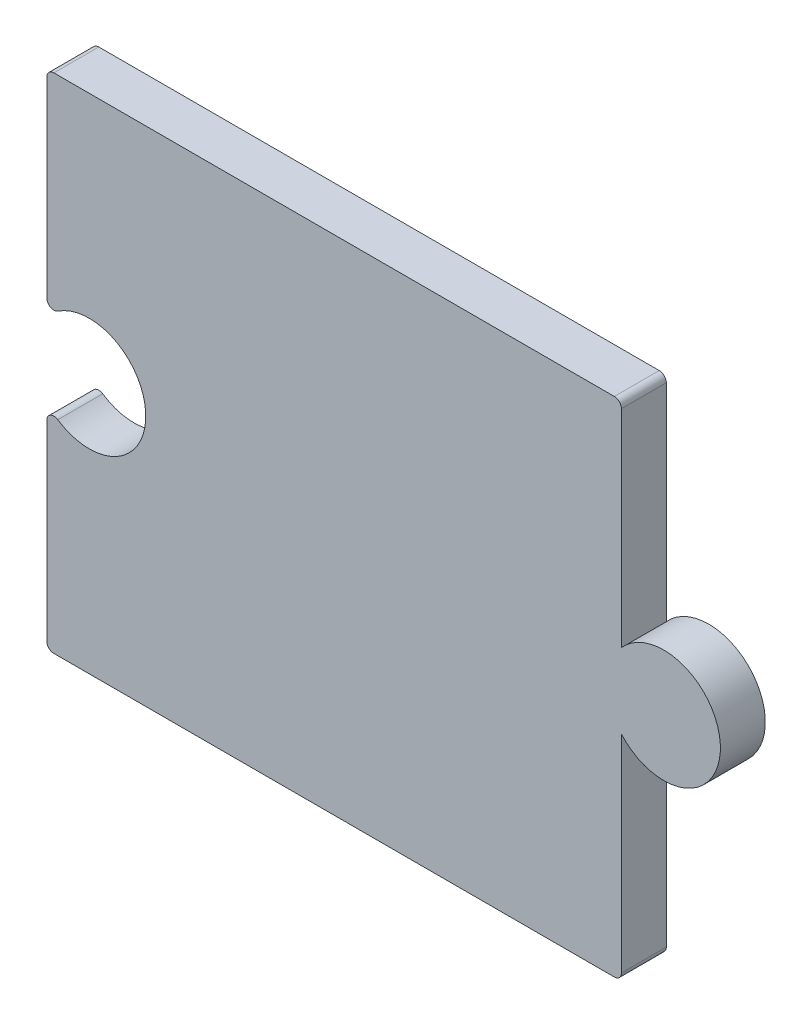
ISO-10303-21;
HEADER;
FILE_DESCRIPTION(('STEP AP214'),'2;1');
FILE_NAME('part.step','',(''),(''),'','','');
FILE_SCHEMA(('AUTOMOTIVE_DESIGN { 1 0 10303 214 1 1 1 1 }'));
ENDSEC;
DATA;
#1=APPLICATION_CONTEXT('core data for automotive mechanical design processes');
#2=APPLICATION_PROTOCOL_DEFINITION('international standard','automotive_design',2000,#1);
#3=PRODUCT_CONTEXT('',#1,'mechanical');
#4=PRODUCT('Part','Part','',(#3));
#5=PRODUCT_RELATED_PRODUCT_CATEGORY('part','',(#4));
#6=PRODUCT_DEFINITION_FORMATION('','',#4);
#7=PRODUCT_DEFINITION_CONTEXT('part definition',#1,'design');
#8=PRODUCT_DEFINITION('design','',#6,#7);
#9=PRODUCT_DEFINITION_SHAPE('','',#8);
#10=(LENGTH_UNIT() NAMED_UNIT(*) SI_UNIT(.MILLI.,.METRE.));
#11=(NAMED_UNIT(*) PLANE_ANGLE_UNIT() SI_UNIT($,.RADIAN.));
#12=(NAMED_UNIT(*) SI_UNIT($,.STERADIAN.) SOLID_ANGLE_UNIT());
#13=UNCERTAINTY_MEASURE_WITH_UNIT(LENGTH_MEASURE(1.E-05),#10,'distance_accuracy_value','');
#14=(GEOMETRIC_REPRESENTATION_CONTEXT(3) GLOBAL_UNCERTAINTY_ASSIGNED_CONTEXT((#13)) GLOBAL_UNIT_ASSIGNED_CONTEXT((#10,
#11,#12)) REPRESENTATION_CONTEXT('',''));
#15=CARTESIAN_POINT('',(0.,0.,0.));
#16=DIRECTION('',(0.,0.,1.));
#17=DIRECTION('',(1.,0.,0.));
#18=AXIS2_PLACEMENT_3D('',#15,#16,#17);
#19=CARTESIAN_POINT('',(0.,15.1342486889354,3.175));
#20=DIRECTION('',(1.,0.,0.));
#21=DIRECTION('',(0.,0.,-1.));
#22=AXIS2_PLACEMENT_3D('',#19,#20,#21);
#23=PLANE('',#22);
#24=DIRECTION('',(0.,-1.,0.));
#25=VECTOR('',#24,1.);
#26=CARTESIAN_POINT('',(0.,15.1342486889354,3.175));
#27=LINE('',#26,#25);
#28=CARTESIAN_POINT('',(0.,14.0383426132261,3.175));
#29=VERTEX_POINT('',#28);
#30=CARTESIAN_POINT('',(0.,0.5,3.175));
#31=VERTEX_POINT('',#30);
#32=EDGE_CURVE('E193',#29,#31,#27,.T.);
#33=ORIENTED_EDGE('',*,*,#32,.F.);
#34=DIRECTION('',(0.,0.,-1.));
#35=VECTOR('',#34,1.);
#36=CARTESIAN_POINT('',(0.,14.0383426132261,3.175));
#37=LINE('',#36,#35);
#38=CARTESIAN_POINT('',(0.,14.0383426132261,0.));
#39=VERTEX_POINT('',#38);
#40=EDGE_CURVE('E196',#29,#39,#37,.T.);
#41=ORIENTED_EDGE('',*,*,#40,.T.);
#42=DIRECTION('',(0.,-1.,0.));
#43=VECTOR('',#42,1.);
#44=CARTESIAN_POINT('',(0.,15.1342486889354,0.));
#45=LINE('',#44,#43);
#46=CARTESIAN_POINT('',(0.,0.5,0.));
#47=VERTEX_POINT('',#46);
#48=EDGE_CURVE('E173',#39,#47,#45,.T.);
#49=ORIENTED_EDGE('',*,*,#48,.T.);
#50=DIRECTION('',(0.,0.,-1.));
#51=VECTOR('',#50,1.);
#52=CARTESIAN_POINT('',(0.,0.5,3.175));
#53=LINE('',#52,#51);
#54=EDGE_CURVE('E156',#47,#31,#53,.F.);
#55=ORIENTED_EDGE('',*,*,#54,.T.);
#56=EDGE_LOOP('',(#33,#41,#49,#55));
#57=FACE_BOUND('',#56,.T.);
#58=ADVANCED_FACE('F33',(#57),#23,.F.);
#59=CARTESIAN_POINT('',(0.,0.,3.175));
#60=DIRECTION('',(0.,1.,0.));
#61=DIRECTION('',(-1.,0.,0.));
#62=AXIS2_PLACEMENT_3D('',#59,#60,#61);
#63=PLANE('',#62);
#64=DIRECTION('',(1.,0.,0.));
#65=VECTOR('',#64,1.);
#66=CARTESIAN_POINT('',(0.,0.,0.));
#67=LINE('',#66,#65);
#68=CARTESIAN_POINT('',(0.5,0.,0.));
#69=VERTEX_POINT('',#68);
#70=CARTESIAN_POINT('',(40.14,0.,0.));
#71=VERTEX_POINT('',#70);
#72=EDGE_CURVE('E176',#69,#71,#67,.T.);
#73=ORIENTED_EDGE('',*,*,#72,.T.);
#74=DIRECTION('',(0.,0.,-1.));
#75=VECTOR('',#74,1.);
#76=CARTESIAN_POINT('',(40.14,0.,3.175));
#77=LINE('',#76,#75);
#78=CARTESIAN_POINT('',(40.14,0.,3.175));
#79=VERTEX_POINT('',#78);
#80=EDGE_CURVE('E235',#71,#79,#77,.F.);
#81=ORIENTED_EDGE('',*,*,#80,.T.);
#82=DIRECTION('',(1.,0.,0.));
#83=VECTOR('',#82,1.);
#84=CARTESIAN_POINT('',(0.,0.,3.175));
#85=LINE('',#84,#83);
#86=CARTESIAN_POINT('',(0.5,0.,3.175));
#87=VERTEX_POINT('',#86);
#88=EDGE_CURVE('E147',#87,#79,#85,.T.);
#89=ORIENTED_EDGE('',*,*,#88,.F.);
#90=DIRECTION('',(0.,0.,-1.));
#91=VECTOR('',#90,1.);
#92=CARTESIAN_POINT('',(0.5,0.,3.175));
#93=LINE('',#92,#91);
#94=EDGE_CURVE('E232',#87,#69,#93,.T.);
#95=ORIENTED_EDGE('',*,*,#94,.T.);
#96=EDGE_LOOP('',(#73,#81,#89,#95));
#97=FACE_BOUND('',#96,.T.);
#98=ADVANCED_FACE('F294',(#97),#63,.F.);
#99=CARTESIAN_POINT('',(40.64,15.1342486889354,3.175));
#100=DIRECTION('',(-1.,0.,0.));
#101=DIRECTION('',(0.,-1.,0.));
#102=AXIS2_PLACEMENT_3D('',#99,#100,#101);
#103=PLANE('',#102);
#104=DIRECTION('',(0.,1.,0.));
#105=VECTOR('',#104,1.);
#106=CARTESIAN_POINT('',(40.64,15.1342486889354,3.175));
#107=LINE('',#106,#105);
#108=CARTESIAN_POINT('',(40.64,0.499999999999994,3.175));
#109=VERTEX_POINT('',#108);
#110=CARTESIAN_POINT('',(40.64,15.1342486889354,3.175));
#111=VERTEX_POINT('',#110);
#112=EDGE_CURVE('E133',#109,#111,#107,.T.);
#113=ORIENTED_EDGE('',*,*,#112,.F.);
#114=DIRECTION('',(0.,0.,-1.));
#115=VECTOR('',#114,1.);
#116=CARTESIAN_POINT('',(40.64,0.499999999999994,3.175));
#117=LINE('',#116,#115);
#118=CARTESIAN_POINT('',(40.64,0.499999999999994,0.));
#119=VERTEX_POINT('',#118);
#120=EDGE_CURVE('E230',#109,#119,#117,.T.);
#121=ORIENTED_EDGE('',*,*,#120,.T.);
#122=DIRECTION('',(0.,1.,0.));
#123=VECTOR('',#122,1.);
#124=CARTESIAN_POINT('',(40.64,15.1342486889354,0.));
#125=LINE('',#124,#123);
#126=CARTESIAN_POINT('',(40.64,15.1342486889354,0.));
#127=VERTEX_POINT('',#126);
#128=EDGE_CURVE('E153',#119,#127,#125,.T.);
#129=ORIENTED_EDGE('',*,*,#128,.T.);
#130=DIRECTION('',(0.,0.,-1.));
#131=VECTOR('',#130,1.);
#132=CARTESIAN_POINT('',(40.64,15.1342486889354,3.175));
#133=LINE('',#132,#131);
#134=EDGE_CURVE('E150',#111,#127,#133,.T.);
#135=ORIENTED_EDGE('',*,*,#134,.F.);
#136=EDGE_LOOP('',(#113,#121,#129,#135));
#137=FACE_BOUND('',#136,.T.);
#138=ADVANCED_FACE('F151',(#137),#103,.F.);
#139=CARTESIAN_POINT('',(43.64,17.78,3.175));
#140=DIRECTION('',(0.,0.,-1.));
#141=DIRECTION('',(-1.,0.,0.));
#142=AXIS2_PLACEMENT_3D('',#139,#140,#141);
#143=CYLINDRICAL_SURFACE('',#142,4.);
#144=CARTESIAN_POINT('',(43.64,17.78,0.));
#145=DIRECTION('',(0.,0.,1.));
#146=DIRECTION('',(1.,0.,0.));
#147=AXIS2_PLACEMENT_3D('',#144,#145,#146);
#148=CIRCLE('',#147,4.);
#149=CARTESIAN_POINT('',(40.64,20.4257513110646,0.));
#150=VERTEX_POINT('',#149);
#151=EDGE_CURVE('E180',#127,#150,#148,.T.);
#152=ORIENTED_EDGE('',*,*,#151,.T.);
#153=DIRECTION('',(0.,0.,-1.));
#154=VECTOR('',#153,1.);
#155=CARTESIAN_POINT('',(40.64,20.4257513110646,3.175));
#156=LINE('',#155,#154);
#157=CARTESIAN_POINT('',(40.64,20.4257513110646,3.175));
#158=VERTEX_POINT('',#157);
#159=EDGE_CURVE('E157',#158,#150,#156,.T.);
#160=ORIENTED_EDGE('',*,*,#159,.F.);
#161=CARTESIAN_POINT('',(43.64,17.78,3.175));
#162=DIRECTION('',(0.,0.,1.));
#163=DIRECTION('',(1.,0.,0.));
#164=AXIS2_PLACEMENT_3D('',#161,#162,#163);
#165=CIRCLE('',#164,4.);
#166=EDGE_CURVE('E139',#111,#158,#165,.T.);
#167=ORIENTED_EDGE('',*,*,#166,.F.);
#168=ORIENTED_EDGE('',*,*,#134,.T.);
#169=EDGE_LOOP('',(#152,#160,#167,#168));
#170=FACE_BOUND('',#169,.T.);
#171=ADVANCED_FACE('F159',(#170),#143,.T.);
#172=CARTESIAN_POINT('',(40.64,35.56,3.175));
#173=DIRECTION('',(-1.,0.,0.));
#174=DIRECTION('',(0.,-1.,0.));
#175=AXIS2_PLACEMENT_3D('',#172,#173,#174);
#176=PLANE('',#175);
#177=DIRECTION('',(0.,1.,0.));
#178=VECTOR('',#177,1.);
#179=CARTESIAN_POINT('',(40.64,35.56,0.));
#180=LINE('',#179,#178);
#181=CARTESIAN_POINT('',(40.64,35.06,0.));
#182=VERTEX_POINT('',#181);
#183=EDGE_CURVE('E182',#150,#182,#180,.T.);
#184=ORIENTED_EDGE('',*,*,#183,.T.);
#185=DIRECTION('',(0.,0.,-1.));
#186=VECTOR('',#185,1.);
#187=CARTESIAN_POINT('',(40.64,35.06,3.175));
#188=LINE('',#187,#186);
#189=CARTESIAN_POINT('',(40.64,35.06,3.175));
#190=VERTEX_POINT('',#189);
#191=EDGE_CURVE('E11',#182,#190,#188,.F.);
#192=ORIENTED_EDGE('',*,*,#191,.T.);
#193=DIRECTION('',(0.,1.,0.));
#194=VECTOR('',#193,1.);
#195=CARTESIAN_POINT('',(40.64,35.56,3.175));
#196=LINE('',#195,#194);
#197=EDGE_CURVE('E162',#158,#190,#196,.T.);
#198=ORIENTED_EDGE('',*,*,#197,.F.);
#199=ORIENTED_EDGE('',*,*,#159,.T.);
#200=EDGE_LOOP('',(#184,#192,#198,#199));
#201=FACE_BOUND('',#200,.T.);
#202=ADVANCED_FACE('F282',(#201),#176,.F.);
#203=CARTESIAN_POINT('',(0.,35.56,3.175));
#204=DIRECTION('',(0.,-1.,0.));
#205=DIRECTION('',(1.,0.,0.));
#206=AXIS2_PLACEMENT_3D('',#203,#204,#205);
#207=PLANE('',#206);
#208=DIRECTION('',(-1.,0.,0.));
#209=VECTOR('',#208,1.);
#210=CARTESIAN_POINT('',(0.,35.56,3.175));
#211=LINE('',#210,#209);
#212=CARTESIAN_POINT('',(40.14,35.56,3.175));
#213=VERTEX_POINT('',#212);
#214=CARTESIAN_POINT('',(0.5,35.56,3.175));
#215=VERTEX_POINT('',#214);
#216=EDGE_CURVE('E164',#213,#215,#211,.T.);
#217=ORIENTED_EDGE('',*,*,#216,.F.);
#218=DIRECTION('',(0.,0.,-1.));
#219=VECTOR('',#218,1.);
#220=CARTESIAN_POINT('',(40.14,35.56,3.175));
#221=LINE('',#220,#219);
#222=CARTESIAN_POINT('',(40.14,35.56,0.));
#223=VERTEX_POINT('',#222);
#224=EDGE_CURVE('E41',#213,#223,#221,.T.);
#225=ORIENTED_EDGE('',*,*,#224,.T.);
#226=DIRECTION('',(-1.,0.,0.));
#227=VECTOR('',#226,1.);
#228=CARTESIAN_POINT('',(0.,35.56,0.));
#229=LINE('',#228,#227);
#230=CARTESIAN_POINT('',(0.5,35.56,0.));
#231=VERTEX_POINT('',#230);
#232=EDGE_CURVE('E185',#223,#231,#229,.T.);
#233=ORIENTED_EDGE('',*,*,#232,.T.);
#234=DIRECTION('',(0.,0.,-1.));
#235=VECTOR('',#234,1.);
#236=CARTESIAN_POINT('',(0.5,35.56,3.175));
#237=LINE('',#236,#235);
#238=EDGE_CURVE('E237',#231,#215,#237,.F.);
#239=ORIENTED_EDGE('',*,*,#238,.T.);
#240=EDGE_LOOP('',(#217,#225,#233,#239));
#241=FACE_BOUND('',#240,.T.);
#242=ADVANCED_FACE('F243',(#241),#207,.F.);
#243=CARTESIAN_POINT('',(0.,35.56,3.175));
#244=DIRECTION('',(1.,0.,0.));
#245=DIRECTION('',(0.,0.,-1.));
#246=AXIS2_PLACEMENT_3D('',#243,#244,#245);
#247=PLANE('',#246);
#248=DIRECTION('',(0.,-1.,0.));
#249=VECTOR('',#248,1.);
#250=CARTESIAN_POINT('',(0.,35.56,0.));
#251=LINE('',#250,#249);
#252=CARTESIAN_POINT('',(0.,35.06,0.));
#253=VERTEX_POINT('',#252);
#254=CARTESIAN_POINT('',(0.,21.5216573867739,0.));
#255=VERTEX_POINT('',#254);
#256=EDGE_CURVE('E188',#253,#255,#251,.T.);
#257=ORIENTED_EDGE('',*,*,#256,.T.);
#258=DIRECTION('',(0.,0.,-1.));
#259=VECTOR('',#258,1.);
#260=CARTESIAN_POINT('',(0.,21.5216573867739,3.175));
#261=LINE('',#260,#259);
#262=CARTESIAN_POINT('',(0.,21.5216573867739,3.175));
#263=VERTEX_POINT('',#262);
#264=EDGE_CURVE('E48',#255,#263,#261,.F.);
#265=ORIENTED_EDGE('',*,*,#264,.T.);
#266=DIRECTION('',(0.,-1.,0.));
#267=VECTOR('',#266,1.);
#268=CARTESIAN_POINT('',(0.,35.56,3.175));
#269=LINE('',#268,#267);
#270=CARTESIAN_POINT('',(0.,35.06,3.175));
#271=VERTEX_POINT('',#270);
#272=EDGE_CURVE('E169',#271,#263,#269,.T.);
#273=ORIENTED_EDGE('',*,*,#272,.F.);
#274=DIRECTION('',(0.,0.,-1.));
#275=VECTOR('',#274,1.);
#276=CARTESIAN_POINT('',(0.,35.06,3.175));
#277=LINE('',#276,#275);
#278=EDGE_CURVE('E226',#271,#253,#277,.T.);
#279=ORIENTED_EDGE('',*,*,#278,.T.);
#280=EDGE_LOOP('',(#257,#265,#273,#279));
#281=FACE_BOUND('',#280,.T.);
#282=ADVANCED_FACE('F254',(#281),#247,.F.);
#283=CARTESIAN_POINT('',(3.,17.78,3.175));
#284=DIRECTION('',(0.,0.,-1.));
#285=DIRECTION('',(-1.,0.,0.));
#286=AXIS2_PLACEMENT_3D('',#283,#284,#285);
#287=CYLINDRICAL_SURFACE('',#286,4.);
#288=CARTESIAN_POINT('',(3.,17.78,0.));
#289=DIRECTION('',(0.,0.,-1.));
#290=DIRECTION('',(1.,0.,0.));
#291=AXIS2_PLACEMENT_3D('',#288,#289,#290);
#292=CIRCLE('',#291,4.);
#293=CARTESIAN_POINT('',(0.777777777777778,21.1059176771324,0.));
#294=VERTEX_POINT('',#293);
#295=CARTESIAN_POINT('',(0.777777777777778,14.4540823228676,0.));
#296=VERTEX_POINT('',#295);
#297=EDGE_CURVE('E190',#294,#296,#292,.T.);
#298=ORIENTED_EDGE('',*,*,#297,.T.);
#299=DIRECTION('',(0.,0.,-1.));
#300=VECTOR('',#299,1.);
#301=CARTESIAN_POINT('',(0.777777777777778,14.4540823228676,3.175));
#302=LINE('',#301,#300);
#303=CARTESIAN_POINT('',(0.777777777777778,14.4540823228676,3.175));
#304=VERTEX_POINT('',#303);
#305=EDGE_CURVE('E214',#296,#304,#302,.F.);
#306=ORIENTED_EDGE('',*,*,#305,.T.);
#307=CARTESIAN_POINT('',(3.,17.78,3.175));
#308=DIRECTION('',(0.,0.,-1.));
#309=DIRECTION('',(1.,0.,0.));
#310=AXIS2_PLACEMENT_3D('',#307,#308,#309);
#311=CIRCLE('',#310,4.);
#312=CARTESIAN_POINT('',(0.777777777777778,21.1059176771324,3.175));
#313=VERTEX_POINT('',#312);
#314=EDGE_CURVE('E171',#313,#304,#311,.T.);
#315=ORIENTED_EDGE('',*,*,#314,.F.);
#316=DIRECTION('',(0.,0.,-1.));
#317=VECTOR('',#316,1.);
#318=CARTESIAN_POINT('',(0.777777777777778,21.1059176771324,3.175));
#319=LINE('',#318,#317);
#320=EDGE_CURVE('E211',#313,#294,#319,.T.);
#321=ORIENTED_EDGE('',*,*,#320,.T.);
#322=EDGE_LOOP('',(#298,#306,#315,#321));
#323=FACE_BOUND('',#322,.T.);
#324=ADVANCED_FACE('F262',(#323),#287,.F.);
#325=CARTESIAN_POINT('',(43.64,17.78,3.175));
#326=DIRECTION('',(0.,0.,1.));
#327=DIRECTION('',(1.,0.,0.));
#328=AXIS2_PLACEMENT_3D('',#325,#326,#327);
#329=PLANE('',#328);
#330=ORIENTED_EDGE('',*,*,#314,.T.);
#331=CARTESIAN_POINT('',(0.5,14.0383426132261,3.175));
#332=DIRECTION('',(0.,0.,1.));
#333=DIRECTION('',(1.,0.,0.));
#334=AXIS2_PLACEMENT_3D('',#331,#332,#333);
#335=CIRCLE('',#334,0.5);
#336=EDGE_CURVE('E224',#304,#29,#335,.T.);
#337=ORIENTED_EDGE('',*,*,#336,.T.);
#338=ORIENTED_EDGE('',*,*,#32,.T.);
#339=CARTESIAN_POINT('',(0.5,0.5,3.175));
#340=DIRECTION('',(0.,0.,1.));
#341=DIRECTION('',(1.,0.,0.));
#342=AXIS2_PLACEMENT_3D('',#339,#340,#341);
#343=CIRCLE('',#342,0.5);
#344=EDGE_CURVE('E219',#31,#87,#343,.T.);
#345=ORIENTED_EDGE('',*,*,#344,.T.);
#346=ORIENTED_EDGE('',*,*,#88,.T.);
#347=CARTESIAN_POINT('',(40.14,0.499999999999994,3.175));
#348=DIRECTION('',(0.,0.,1.));
#349=DIRECTION('',(1.,0.,0.));
#350=AXIS2_PLACEMENT_3D('',#347,#348,#349);
#351=CIRCLE('',#350,0.5);
#352=EDGE_CURVE('E143',#79,#109,#351,.T.);
#353=ORIENTED_EDGE('',*,*,#352,.T.);
#354=ORIENTED_EDGE('',*,*,#112,.T.);
#355=ORIENTED_EDGE('',*,*,#166,.T.);
#356=ORIENTED_EDGE('',*,*,#197,.T.);
#357=CARTESIAN_POINT('',(40.14,35.06,3.175));
#358=DIRECTION('',(0.,0.,1.));
#359=DIRECTION('',(1.,0.,0.));
#360=AXIS2_PLACEMENT_3D('',#357,#358,#359);
#361=CIRCLE('',#360,0.5);
#362=EDGE_CURVE('E217',#190,#213,#361,.T.);
#363=ORIENTED_EDGE('',*,*,#362,.T.);
#364=ORIENTED_EDGE('',*,*,#216,.T.);
#365=CARTESIAN_POINT('',(0.5,35.06,3.175));
#366=DIRECTION('',(0.,0.,1.));
#367=DIRECTION('',(1.,0.,0.));
#368=AXIS2_PLACEMENT_3D('',#365,#366,#367);
#369=CIRCLE('',#368,0.5);
#370=EDGE_CURVE('E55',#215,#271,#369,.T.);
#371=ORIENTED_EDGE('',*,*,#370,.T.);
#372=ORIENTED_EDGE('',*,*,#272,.T.);
#373=CARTESIAN_POINT('',(0.5,21.5216573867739,3.175));
#374=DIRECTION('',(0.,0.,1.));
#375=DIRECTION('',(1.,0.,0.));
#376=AXIS2_PLACEMENT_3D('',#373,#374,#375);
#377=CIRCLE('',#376,0.5);
#378=EDGE_CURVE('E222',#263,#313,#377,.T.);
#379=ORIENTED_EDGE('',*,*,#378,.T.);
#380=EDGE_LOOP('',(#330,#337,#338,#345,#346,#353,#354,#355,#356,#363,#364,#371,#372,#379));
#381=FACE_BOUND('',#380,.T.);
#382=ADVANCED_FACE('F136',(#381),#329,.T.);
#383=CARTESIAN_POINT('',(43.64,17.78,0.));
#384=DIRECTION('',(0.,0.,1.));
#385=DIRECTION('',(1.,0.,0.));
#386=AXIS2_PLACEMENT_3D('',#383,#384,#385);
#387=PLANE('',#386);
#388=ORIENTED_EDGE('',*,*,#48,.F.);
#389=CARTESIAN_POINT('',(0.5,14.0383426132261,0.));
#390=DIRECTION('',(0.,0.,1.));
#391=DIRECTION('',(1.,0.,0.));
#392=AXIS2_PLACEMENT_3D('',#389,#390,#391);
#393=CIRCLE('',#392,0.5);
#394=EDGE_CURVE('E209',#39,#296,#393,.F.);
#395=ORIENTED_EDGE('',*,*,#394,.T.);
#396=ORIENTED_EDGE('',*,*,#297,.F.);
#397=CARTESIAN_POINT('',(0.5,21.5216573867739,0.));
#398=DIRECTION('',(0.,0.,1.));
#399=DIRECTION('',(1.,0.,0.));
#400=AXIS2_PLACEMENT_3D('',#397,#398,#399);
#401=CIRCLE('',#400,0.5);
#402=EDGE_CURVE('E207',#294,#255,#401,.F.);
#403=ORIENTED_EDGE('',*,*,#402,.T.);
#404=ORIENTED_EDGE('',*,*,#256,.F.);
#405=CARTESIAN_POINT('',(0.5,35.06,0.));
#406=DIRECTION('',(0.,0.,1.));
#407=DIRECTION('',(1.,0.,0.));
#408=AXIS2_PLACEMENT_3D('',#405,#406,#407);
#409=CIRCLE('',#408,0.5);
#410=EDGE_CURVE('E199',#253,#231,#409,.F.);
#411=ORIENTED_EDGE('',*,*,#410,.T.);
#412=ORIENTED_EDGE('',*,*,#232,.F.);
#413=CARTESIAN_POINT('',(40.14,35.06,0.));
#414=DIRECTION('',(0.,0.,1.));
#415=DIRECTION('',(1.,0.,0.));
#416=AXIS2_PLACEMENT_3D('',#413,#414,#415);
#417=CIRCLE('',#416,0.5);
#418=EDGE_CURVE('E201',#223,#182,#417,.F.);
#419=ORIENTED_EDGE('',*,*,#418,.T.);
#420=ORIENTED_EDGE('',*,*,#183,.F.);
#421=ORIENTED_EDGE('',*,*,#151,.F.);
#422=ORIENTED_EDGE('',*,*,#128,.F.);
#423=CARTESIAN_POINT('',(40.14,0.499999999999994,0.));
#424=DIRECTION('',(0.,0.,1.));
#425=DIRECTION('',(1.,0.,0.));
#426=AXIS2_PLACEMENT_3D('',#423,#424,#425);
#427=CIRCLE('',#426,0.5);
#428=EDGE_CURVE('E205',#119,#71,#427,.F.);
#429=ORIENTED_EDGE('',*,*,#428,.T.);
#430=ORIENTED_EDGE('',*,*,#72,.F.);
#431=CARTESIAN_POINT('',(0.5,0.5,0.));
#432=DIRECTION('',(0.,0.,1.));
#433=DIRECTION('',(1.,0.,0.));
#434=AXIS2_PLACEMENT_3D('',#431,#432,#433);
#435=CIRCLE('',#434,0.5);
#436=EDGE_CURVE('E203',#69,#47,#435,.F.);
#437=ORIENTED_EDGE('',*,*,#436,.T.);
#438=EDGE_LOOP('',(#388,#395,#396,#403,#404,#411,#412,#419,#420,#421,#422,#429,#430,#437));
#439=FACE_BOUND('',#438,.T.);
#440=ADVANCED_FACE('F249',(#439),#387,.F.);
#441=CARTESIAN_POINT('',(0.5,14.0383426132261,3.175));
#442=DIRECTION('',(0.,0.,-1.));
#443=DIRECTION('',(-1.,0.,0.));
#444=AXIS2_PLACEMENT_3D('',#441,#442,#443);
#445=CYLINDRICAL_SURFACE('',#444,0.5);
#446=ORIENTED_EDGE('',*,*,#336,.F.);
#447=ORIENTED_EDGE('',*,*,#305,.F.);
#448=ORIENTED_EDGE('',*,*,#394,.F.);
#449=ORIENTED_EDGE('',*,*,#40,.F.);
#450=EDGE_LOOP('',(#446,#447,#448,#449));
#451=FACE_BOUND('',#450,.T.);
#452=ADVANCED_FACE('F267',(#451),#445,.T.);
#453=CARTESIAN_POINT('',(0.5,21.5216573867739,3.175));
#454=DIRECTION('',(0.,0.,-1.));
#455=DIRECTION('',(-1.,0.,0.));
#456=AXIS2_PLACEMENT_3D('',#453,#454,#455);
#457=CYLINDRICAL_SURFACE('',#456,0.5);
#458=ORIENTED_EDGE('',*,*,#378,.F.);
#459=ORIENTED_EDGE('',*,*,#264,.F.);
#460=ORIENTED_EDGE('',*,*,#402,.F.);
#461=ORIENTED_EDGE('',*,*,#320,.F.);
#462=EDGE_LOOP('',(#458,#459,#460,#461));
#463=FACE_BOUND('',#462,.T.);
#464=ADVANCED_FACE('F259',(#463),#457,.T.);
#465=CARTESIAN_POINT('',(40.14,0.499999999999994,3.175));
#466=DIRECTION('',(0.,0.,-1.));
#467=DIRECTION('',(-1.,0.,0.));
#468=AXIS2_PLACEMENT_3D('',#465,#466,#467);
#469=CYLINDRICAL_SURFACE('',#468,0.5);
#470=ORIENTED_EDGE('',*,*,#352,.F.);
#471=ORIENTED_EDGE('',*,*,#80,.F.);
#472=ORIENTED_EDGE('',*,*,#428,.F.);
#473=ORIENTED_EDGE('',*,*,#120,.F.);
#474=EDGE_LOOP('',(#470,#471,#472,#473));
#475=FACE_BOUND('',#474,.T.);
#476=ADVANCED_FACE('F279',(#475),#469,.T.);
#477=CARTESIAN_POINT('',(0.5,0.5,3.175));
#478=DIRECTION('',(0.,0.,-1.));
#479=DIRECTION('',(-1.,0.,0.));
#480=AXIS2_PLACEMENT_3D('',#477,#478,#479);
#481=CYLINDRICAL_SURFACE('',#480,0.5);
#482=ORIENTED_EDGE('',*,*,#344,.F.);
#483=ORIENTED_EDGE('',*,*,#54,.F.);
#484=ORIENTED_EDGE('',*,*,#436,.F.);
#485=ORIENTED_EDGE('',*,*,#94,.F.);
#486=EDGE_LOOP('',(#482,#483,#484,#485));
#487=FACE_BOUND('',#486,.T.);
#488=ADVANCED_FACE('F286',(#487),#481,.T.);
#489=CARTESIAN_POINT('',(40.14,35.06,3.175));
#490=DIRECTION('',(0.,0.,-1.));
#491=DIRECTION('',(-1.,0.,0.));
#492=AXIS2_PLACEMENT_3D('',#489,#490,#491);
#493=CYLINDRICAL_SURFACE('',#492,0.5);
#494=ORIENTED_EDGE('',*,*,#362,.F.);
#495=ORIENTED_EDGE('',*,*,#191,.F.);
#496=ORIENTED_EDGE('',*,*,#418,.F.);
#497=ORIENTED_EDGE('',*,*,#224,.F.);
#498=EDGE_LOOP('',(#494,#495,#496,#497));
#499=FACE_BOUND('',#498,.T.);
#500=ADVANCED_FACE('F284',(#499),#493,.T.);
#501=CARTESIAN_POINT('',(0.5,35.06,3.175));
#502=DIRECTION('',(0.,0.,-1.));
#503=DIRECTION('',(-1.,0.,0.));
#504=AXIS2_PLACEMENT_3D('',#501,#502,#503);
#505=CYLINDRICAL_SURFACE('',#504,0.5);
#506=ORIENTED_EDGE('',*,*,#370,.F.);
#507=ORIENTED_EDGE('',*,*,#238,.F.);
#508=ORIENTED_EDGE('',*,*,#410,.F.);
#509=ORIENTED_EDGE('',*,*,#278,.F.);
#510=EDGE_LOOP('',(#506,#507,#508,#509));
#511=FACE_BOUND('',#510,.T.);
#512=ADVANCED_FACE('F35',(#511),#505,.T.);
#513=CLOSED_SHELL('',(#58,#98,#138,#171,#202,#242,#282,#324,#382,#440,#452,#464,#476,#488,#500,#512));
#514=MANIFOLD_SOLID_BREP('B2',#513);
#515=ADVANCED_BREP_SHAPE_REPRESENTATION('',(#18,#514),#14);
#516=SHAPE_DEFINITION_REPRESENTATION(#9,#515);
ENDSEC;
END-ISO-10303-21;
